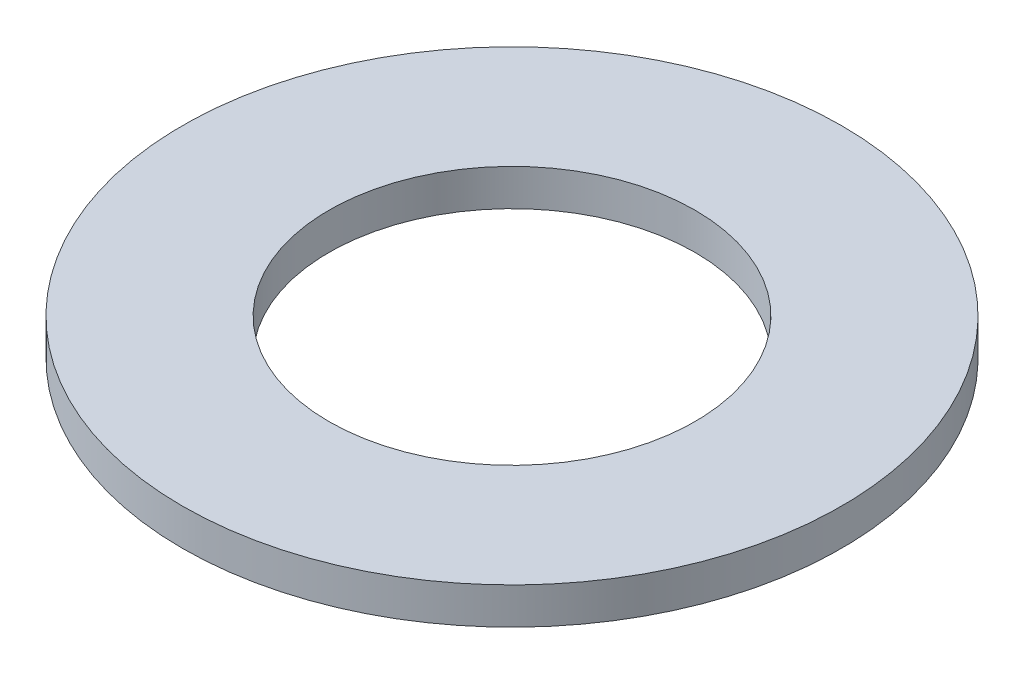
ISO-10303-21;
HEADER;
FILE_DESCRIPTION(('STEP AP214'),'2;1');
FILE_NAME('part.step','',(''),(''),'','','');
FILE_SCHEMA(('AUTOMOTIVE_DESIGN { 1 0 10303 214 1 1 1 1 }'));
ENDSEC;
DATA;
#1=APPLICATION_CONTEXT('core data for automotive mechanical design processes');
#2=APPLICATION_PROTOCOL_DEFINITION('international standard','automotive_design',2000,#1);
#3=PRODUCT_CONTEXT('',#1,'mechanical');
#4=PRODUCT('Part','Part','',(#3));
#5=PRODUCT_RELATED_PRODUCT_CATEGORY('part','',(#4));
#6=PRODUCT_DEFINITION_FORMATION('','',#4);
#7=PRODUCT_DEFINITION_CONTEXT('part definition',#1,'design');
#8=PRODUCT_DEFINITION('design','',#6,#7);
#9=PRODUCT_DEFINITION_SHAPE('','',#8);
#10=(LENGTH_UNIT() NAMED_UNIT(*) SI_UNIT(.MILLI.,.METRE.));
#11=(NAMED_UNIT(*) PLANE_ANGLE_UNIT() SI_UNIT($,.RADIAN.));
#12=(NAMED_UNIT(*) SI_UNIT($,.STERADIAN.) SOLID_ANGLE_UNIT());
#13=UNCERTAINTY_MEASURE_WITH_UNIT(LENGTH_MEASURE(1.E-05),#10,'distance_accuracy_value','');
#14=(GEOMETRIC_REPRESENTATION_CONTEXT(3) GLOBAL_UNCERTAINTY_ASSIGNED_CONTEXT((#13)) GLOBAL_UNIT_ASSIGNED_CONTEXT((#10,
#11,#12)) REPRESENTATION_CONTEXT('',''));
#15=CARTESIAN_POINT('',(0.,0.,0.));
#16=DIRECTION('',(0.,0.,1.));
#17=DIRECTION('',(1.,0.,0.));
#18=AXIS2_PLACEMENT_3D('',#15,#16,#17);
#19=CARTESIAN_POINT('',(0.,1.,0.));
#20=DIRECTION('',(0.,1.,0.));
#21=DIRECTION('',(0.,0.,1.));
#22=AXIS2_PLACEMENT_3D('',#19,#20,#21);
#23=PLANE('',#22);
#24=CARTESIAN_POINT('',(0.,1.,0.));
#25=DIRECTION('',(0.,1.,0.));
#26=DIRECTION('',(0.,0.,1.));
#27=AXIS2_PLACEMENT_3D('',#24,#25,#26);
#28=CIRCLE('',#27,9.);
#29=CARTESIAN_POINT('',(0.,1.,9.));
#30=VERTEX_POINT('',#29);
#31=EDGE_CURVE('E10',#30,#30,#28,.T.);
#32=ORIENTED_EDGE('',*,*,#31,.T.);
#33=EDGE_LOOP('',(#32));
#34=FACE_BOUND('',#33,.T.);
#35=CARTESIAN_POINT('',(0.,1.,0.));
#36=DIRECTION('',(0.,1.,0.));
#37=DIRECTION('',(0.,0.,1.));
#38=AXIS2_PLACEMENT_3D('',#35,#36,#37);
#39=CIRCLE('',#38,5.);
#40=CARTESIAN_POINT('',(0.,1.,5.));
#41=VERTEX_POINT('',#40);
#42=EDGE_CURVE('E42',#41,#41,#39,.T.);
#43=ORIENTED_EDGE('',*,*,#42,.F.);
#44=EDGE_LOOP('',(#43));
#45=FACE_BOUND('',#44,.T.);
#46=ADVANCED_FACE('F31',(#34,#45),#23,.T.);
#47=CARTESIAN_POINT('',(0.,0.,0.));
#48=DIRECTION('',(0.,1.,0.));
#49=DIRECTION('',(0.,0.,1.));
#50=AXIS2_PLACEMENT_3D('',#47,#48,#49);
#51=PLANE('',#50);
#52=CARTESIAN_POINT('',(0.,0.,0.));
#53=DIRECTION('',(0.,1.,0.));
#54=DIRECTION('',(0.,0.,1.));
#55=AXIS2_PLACEMENT_3D('',#52,#53,#54);
#56=CIRCLE('',#55,9.);
#57=CARTESIAN_POINT('',(0.,0.,9.));
#58=VERTEX_POINT('',#57);
#59=EDGE_CURVE('E35',#58,#58,#56,.T.);
#60=ORIENTED_EDGE('',*,*,#59,.F.);
#61=EDGE_LOOP('',(#60));
#62=FACE_BOUND('',#61,.T.);
#63=CARTESIAN_POINT('',(0.,0.,0.));
#64=DIRECTION('',(0.,1.,0.));
#65=DIRECTION('',(0.,0.,1.));
#66=AXIS2_PLACEMENT_3D('',#63,#64,#65);
#67=CIRCLE('',#66,5.);
#68=CARTESIAN_POINT('',(0.,0.,5.));
#69=VERTEX_POINT('',#68);
#70=EDGE_CURVE('E44',#69,#69,#67,.T.);
#71=ORIENTED_EDGE('',*,*,#70,.T.);
#72=EDGE_LOOP('',(#71));
#73=FACE_BOUND('',#72,.T.);
#74=ADVANCED_FACE('F54',(#62,#73),#51,.F.);
#75=CARTESIAN_POINT('',(0.,1.,0.));
#76=DIRECTION('',(0.,-1.,0.));
#77=DIRECTION('',(0.,0.,-1.));
#78=AXIS2_PLACEMENT_3D('',#75,#76,#77);
#79=CYLINDRICAL_SURFACE('',#78,9.);
#80=ORIENTED_EDGE('',*,*,#31,.F.);
#81=EDGE_LOOP('',(#80));
#82=FACE_BOUND('',#81,.T.);
#83=ORIENTED_EDGE('',*,*,#59,.T.);
#84=EDGE_LOOP('',(#83));
#85=FACE_BOUND('',#84,.T.);
#86=ADVANCED_FACE('F33',(#82,#85),#79,.T.);
#87=CARTESIAN_POINT('',(0.,1.,0.));
#88=DIRECTION('',(0.,-1.,0.));
#89=DIRECTION('',(0.,0.,-1.));
#90=AXIS2_PLACEMENT_3D('',#87,#88,#89);
#91=CYLINDRICAL_SURFACE('',#90,5.);
#92=ORIENTED_EDGE('',*,*,#42,.T.);
#93=EDGE_LOOP('',(#92));
#94=FACE_BOUND('',#93,.T.);
#95=ORIENTED_EDGE('',*,*,#70,.F.);
#96=EDGE_LOOP('',(#95));
#97=FACE_BOUND('',#96,.T.);
#98=ADVANCED_FACE('F50',(#94,#97),#91,.F.);
#99=CLOSED_SHELL('',(#46,#74,#86,#98));
#100=MANIFOLD_SOLID_BREP('B2',#99);
#101=ADVANCED_BREP_SHAPE_REPRESENTATION('',(#18,#100),#14);
#102=SHAPE_DEFINITION_REPRESENTATION(#9,#101);
ENDSEC;
END-ISO-10303-21;
